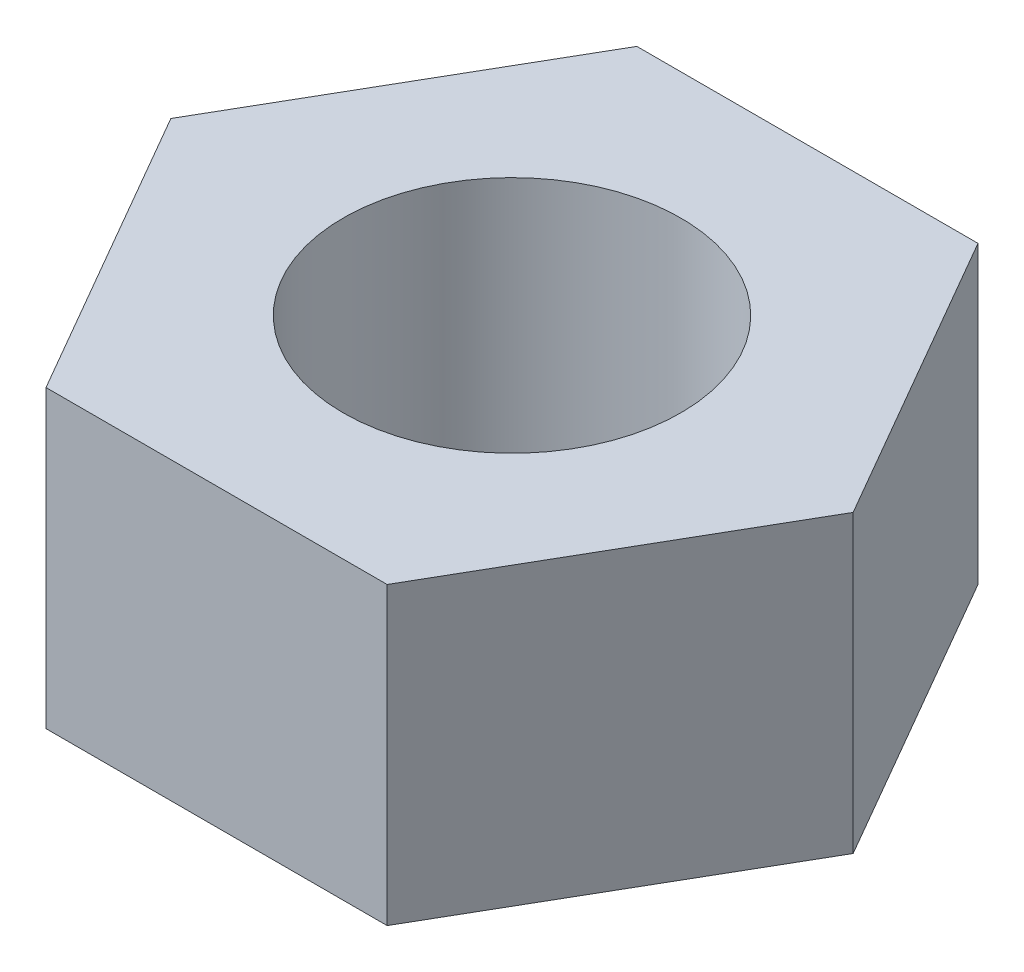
from build123d import *

# Parameters (mm, degrees)
SKETCH1_R           = 3.175
BOSS_EXTRUDE1_DEPTH = 2.778125


with BuildPart() as part:
    # Sketch1 → Boss-Extrude1 (new, symmetric)
    with BuildSketch(Plane(origin=(0, 0, 0), x_dir=(1, 0, 0), z_dir=(0, 1, 0))):
        Polygon((6.415804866, 0), (3.207902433, 5.55625), (-3.207902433, 5.55625), (-6.415804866, 0), (-3.207902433, -5.55625), (3.207902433, -5.55625), align=None)
        with Locations(Location((0, 0, 0), (0, 0, 270))):
            Circle(SKETCH1_R, mode=Mode.SUBTRACT)
    extrude(amount=BOSS_EXTRUDE1_DEPTH, both=True)


solid = part.part
